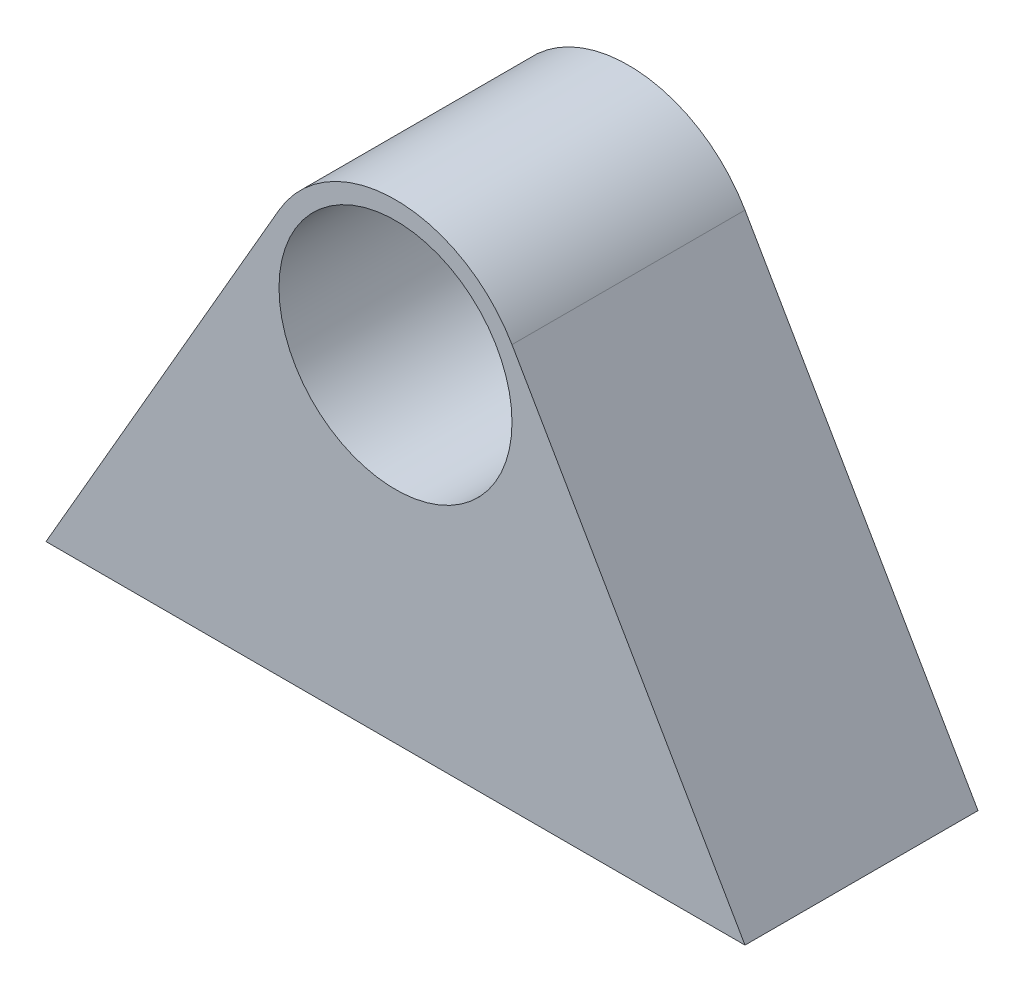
ISO-10303-21;
HEADER;
FILE_DESCRIPTION(('STEP AP214'),'2;1');
FILE_NAME('part.step','',(''),(''),'','','');
FILE_SCHEMA(('AUTOMOTIVE_DESIGN { 1 0 10303 214 1 1 1 1 }'));
ENDSEC;
DATA;
#1=APPLICATION_CONTEXT('core data for automotive mechanical design processes');
#2=APPLICATION_PROTOCOL_DEFINITION('international standard','automotive_design',2000,#1);
#3=PRODUCT_CONTEXT('',#1,'mechanical');
#4=PRODUCT('Part','Part','',(#3));
#5=PRODUCT_RELATED_PRODUCT_CATEGORY('part','',(#4));
#6=PRODUCT_DEFINITION_FORMATION('','',#4);
#7=PRODUCT_DEFINITION_CONTEXT('part definition',#1,'design');
#8=PRODUCT_DEFINITION('design','',#6,#7);
#9=PRODUCT_DEFINITION_SHAPE('','',#8);
#10=(LENGTH_UNIT() NAMED_UNIT(*) SI_UNIT(.MILLI.,.METRE.));
#11=(NAMED_UNIT(*) PLANE_ANGLE_UNIT() SI_UNIT($,.RADIAN.));
#12=(NAMED_UNIT(*) SI_UNIT($,.STERADIAN.) SOLID_ANGLE_UNIT());
#13=UNCERTAINTY_MEASURE_WITH_UNIT(LENGTH_MEASURE(1.E-05),#10,'distance_accuracy_value','');
#14=(GEOMETRIC_REPRESENTATION_CONTEXT(3) GLOBAL_UNCERTAINTY_ASSIGNED_CONTEXT((#13)) GLOBAL_UNIT_ASSIGNED_CONTEXT((#10,
#11,#12)) REPRESENTATION_CONTEXT('',''));
#15=CARTESIAN_POINT('',(0.,0.,0.));
#16=DIRECTION('',(0.,0.,1.));
#17=DIRECTION('',(1.,0.,0.));
#18=AXIS2_PLACEMENT_3D('',#15,#16,#17);
#19=CARTESIAN_POINT('',(30.,0.,10.));
#20=DIRECTION('',(0.,1.,0.));
#21=DIRECTION('',(-1.,0.,0.));
#22=AXIS2_PLACEMENT_3D('',#19,#20,#21);
#23=PLANE('',#22);
#24=DIRECTION('',(1.,0.,0.));
#25=VECTOR('',#24,1.);
#26=CARTESIAN_POINT('',(30.,0.,0.));
#27=LINE('',#26,#25);
#28=CARTESIAN_POINT('',(0.,0.,0.));
#29=VERTEX_POINT('',#28);
#30=CARTESIAN_POINT('',(30.,0.,0.));
#31=VERTEX_POINT('',#30);
#32=EDGE_CURVE('E96',#29,#31,#27,.T.);
#33=ORIENTED_EDGE('',*,*,#32,.T.);
#34=DIRECTION('',(0.,0.,-1.));
#35=VECTOR('',#34,1.);
#36=CARTESIAN_POINT('',(30.,0.,10.));
#37=LINE('',#36,#35);
#38=CARTESIAN_POINT('',(30.,0.,10.));
#39=VERTEX_POINT('',#38);
#40=EDGE_CURVE('E11',#39,#31,#37,.T.);
#41=ORIENTED_EDGE('',*,*,#40,.F.);
#42=DIRECTION('',(1.,0.,0.));
#43=VECTOR('',#42,1.);
#44=CARTESIAN_POINT('',(30.,0.,10.));
#45=LINE('',#44,#43);
#46=CARTESIAN_POINT('',(0.,0.,10.));
#47=VERTEX_POINT('',#46);
#48=EDGE_CURVE('E84',#47,#39,#45,.T.);
#49=ORIENTED_EDGE('',*,*,#48,.F.);
#50=DIRECTION('',(0.,0.,-1.));
#51=VECTOR('',#50,1.);
#52=CARTESIAN_POINT('',(0.,0.,10.));
#53=LINE('',#52,#51);
#54=EDGE_CURVE('E92',#47,#29,#53,.T.);
#55=ORIENTED_EDGE('',*,*,#54,.T.);
#56=EDGE_LOOP('',(#33,#41,#49,#55));
#57=FACE_BOUND('',#56,.T.);
#58=ADVANCED_FACE('F33',(#57),#23,.F.);
#59=CARTESIAN_POINT('',(19.9999999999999,17.3205080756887,10.));
#60=DIRECTION('',(-0.866025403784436,-0.500000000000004,0.));
#61=DIRECTION('',(0.500000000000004,-0.866025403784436,0.));
#62=AXIS2_PLACEMENT_3D('',#59,#60,#61);
#63=PLANE('',#62);
#64=DIRECTION('',(-0.500000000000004,0.866025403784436,0.));
#65=VECTOR('',#64,1.);
#66=CARTESIAN_POINT('',(19.9999999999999,17.3205080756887,0.));
#67=LINE('',#66,#65);
#68=CARTESIAN_POINT('',(19.9999999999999,17.3205080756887,0.));
#69=VERTEX_POINT('',#68);
#70=EDGE_CURVE('E88',#31,#69,#67,.T.);
#71=ORIENTED_EDGE('',*,*,#70,.T.);
#72=DIRECTION('',(0.,0.,-1.));
#73=VECTOR('',#72,1.);
#74=CARTESIAN_POINT('',(19.9999999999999,17.3205080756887,10.));
#75=LINE('',#74,#73);
#76=CARTESIAN_POINT('',(19.9999999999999,17.3205080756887,10.));
#77=VERTEX_POINT('',#76);
#78=EDGE_CURVE('E41',#77,#69,#75,.T.);
#79=ORIENTED_EDGE('',*,*,#78,.F.);
#80=DIRECTION('',(-0.500000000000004,0.866025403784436,0.));
#81=VECTOR('',#80,1.);
#82=CARTESIAN_POINT('',(19.9999999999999,17.3205080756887,10.));
#83=LINE('',#82,#81);
#84=EDGE_CURVE('E79',#39,#77,#83,.T.);
#85=ORIENTED_EDGE('',*,*,#84,.F.);
#86=ORIENTED_EDGE('',*,*,#40,.T.);
#87=EDGE_LOOP('',(#71,#79,#85,#86));
#88=FACE_BOUND('',#87,.T.);
#89=ADVANCED_FACE('F87',(#88),#63,.F.);
#90=CARTESIAN_POINT('',(15.,14.4337567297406,10.));
#91=DIRECTION('',(0.,0.,-1.));
#92=DIRECTION('',(-1.,0.,0.));
#93=AXIS2_PLACEMENT_3D('',#90,#91,#92);
#94=CYLINDRICAL_SURFACE('',#93,5.77350269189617);
#95=CARTESIAN_POINT('',(15.,14.4337567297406,0.));
#96=DIRECTION('',(0.,0.,1.));
#97=DIRECTION('',(-1.,0.,0.));
#98=AXIS2_PLACEMENT_3D('',#95,#96,#97);
#99=CIRCLE('',#98,5.77350269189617);
#100=CARTESIAN_POINT('',(10.0000000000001,17.3205080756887,0.));
#101=VERTEX_POINT('',#100);
#102=EDGE_CURVE('E66',#69,#101,#99,.T.);
#103=ORIENTED_EDGE('',*,*,#102,.T.);
#104=DIRECTION('',(0.,0.,-1.));
#105=VECTOR('',#104,1.);
#106=CARTESIAN_POINT('',(10.0000000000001,17.3205080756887,10.));
#107=LINE('',#106,#105);
#108=CARTESIAN_POINT('',(10.0000000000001,17.3205080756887,10.));
#109=VERTEX_POINT('',#108);
#110=EDGE_CURVE('E89',#109,#101,#107,.T.);
#111=ORIENTED_EDGE('',*,*,#110,.F.);
#112=CARTESIAN_POINT('',(15.,14.4337567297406,10.));
#113=DIRECTION('',(0.,0.,1.));
#114=DIRECTION('',(-1.,0.,0.));
#115=AXIS2_PLACEMENT_3D('',#112,#113,#114);
#116=CIRCLE('',#115,5.77350269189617);
#117=EDGE_CURVE('E82',#77,#109,#116,.T.);
#118=ORIENTED_EDGE('',*,*,#117,.F.);
#119=ORIENTED_EDGE('',*,*,#78,.T.);
#120=EDGE_LOOP('',(#103,#111,#118,#119));
#121=FACE_BOUND('',#120,.T.);
#122=ADVANCED_FACE('F90',(#121),#94,.T.);
#123=CARTESIAN_POINT('',(0.,0.,10.));
#124=DIRECTION('',(0.866025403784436,-0.500000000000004,0.));
#125=DIRECTION('',(0.500000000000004,0.866025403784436,0.));
#126=AXIS2_PLACEMENT_3D('',#123,#124,#125);
#127=PLANE('',#126);
#128=DIRECTION('',(-0.500000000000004,-0.866025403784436,0.));
#129=VECTOR('',#128,1.);
#130=CARTESIAN_POINT('',(0.,0.,0.));
#131=LINE('',#130,#129);
#132=EDGE_CURVE('E72',#101,#29,#131,.T.);
#133=ORIENTED_EDGE('',*,*,#132,.T.);
#134=ORIENTED_EDGE('',*,*,#54,.F.);
#135=DIRECTION('',(-0.500000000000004,-0.866025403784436,0.));
#136=VECTOR('',#135,1.);
#137=CARTESIAN_POINT('',(0.,0.,10.));
#138=LINE('',#137,#136);
#139=EDGE_CURVE('E49',#109,#47,#138,.T.);
#140=ORIENTED_EDGE('',*,*,#139,.F.);
#141=ORIENTED_EDGE('',*,*,#110,.T.);
#142=EDGE_LOOP('',(#133,#134,#140,#141));
#143=FACE_BOUND('',#142,.T.);
#144=ADVANCED_FACE('F104',(#143),#127,.F.);
#145=CARTESIAN_POINT('',(15.,14.4337567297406,10.));
#146=DIRECTION('',(0.,0.,-1.));
#147=DIRECTION('',(-1.,0.,0.));
#148=AXIS2_PLACEMENT_3D('',#145,#146,#147);
#149=PLANE('',#148);
#150=CARTESIAN_POINT('',(15.,14.4337567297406,10.));
#151=DIRECTION('',(0.,0.,1.));
#152=DIRECTION('',(1.,0.,0.));
#153=AXIS2_PLACEMENT_3D('',#150,#151,#152);
#154=CIRCLE('',#153,4.99999999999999);
#155=CARTESIAN_POINT('',(20.,14.4337567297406,10.));
#156=VERTEX_POINT('',#155);
#157=EDGE_CURVE('E110',#156,#156,#154,.T.);
#158=ORIENTED_EDGE('',*,*,#157,.F.);
#159=EDGE_LOOP('',(#158));
#160=FACE_BOUND('',#159,.T.);
#161=ORIENTED_EDGE('',*,*,#48,.T.);
#162=ORIENTED_EDGE('',*,*,#84,.T.);
#163=ORIENTED_EDGE('',*,*,#117,.T.);
#164=ORIENTED_EDGE('',*,*,#139,.T.);
#165=EDGE_LOOP('',(#161,#162,#163,#164));
#166=FACE_BOUND('',#165,.T.);
#167=ADVANCED_FACE('F80',(#160,#166),#149,.F.);
#168=CARTESIAN_POINT('',(15.,14.4337567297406,0.));
#169=DIRECTION('',(0.,0.,-1.));
#170=DIRECTION('',(-1.,0.,0.));
#171=AXIS2_PLACEMENT_3D('',#168,#169,#170);
#172=PLANE('',#171);
#173=CARTESIAN_POINT('',(15.,14.4337567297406,0.));
#174=DIRECTION('',(0.,0.,1.));
#175=DIRECTION('',(1.,0.,0.));
#176=AXIS2_PLACEMENT_3D('',#173,#174,#175);
#177=CIRCLE('',#176,4.99999999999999);
#178=CARTESIAN_POINT('',(20.,14.4337567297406,0.));
#179=VERTEX_POINT('',#178);
#180=EDGE_CURVE('E99',#179,#179,#177,.T.);
#181=ORIENTED_EDGE('',*,*,#180,.T.);
#182=EDGE_LOOP('',(#181));
#183=FACE_BOUND('',#182,.T.);
#184=ORIENTED_EDGE('',*,*,#32,.F.);
#185=ORIENTED_EDGE('',*,*,#132,.F.);
#186=ORIENTED_EDGE('',*,*,#102,.F.);
#187=ORIENTED_EDGE('',*,*,#70,.F.);
#188=EDGE_LOOP('',(#184,#185,#186,#187));
#189=FACE_BOUND('',#188,.T.);
#190=ADVANCED_FACE('F107',(#183,#189),#172,.T.);
#191=CARTESIAN_POINT('',(15.,14.4337567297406,0.));
#192=DIRECTION('',(0.,0.,1.));
#193=DIRECTION('',(1.,0.,0.));
#194=AXIS2_PLACEMENT_3D('',#191,#192,#193);
#195=CYLINDRICAL_SURFACE('',#194,4.99999999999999);
#196=ORIENTED_EDGE('',*,*,#180,.F.);
#197=EDGE_LOOP('',(#196));
#198=FACE_BOUND('',#197,.T.);
#199=ORIENTED_EDGE('',*,*,#157,.T.);
#200=EDGE_LOOP('',(#199));
#201=FACE_BOUND('',#200,.T.);
#202=ADVANCED_FACE('F117',(#198,#201),#195,.F.);
#203=CLOSED_SHELL('',(#58,#89,#122,#144,#167,#190,#202));
#204=MANIFOLD_SOLID_BREP('B2',#203);
#205=ADVANCED_BREP_SHAPE_REPRESENTATION('',(#18,#204),#14);
#206=SHAPE_DEFINITION_REPRESENTATION(#9,#205);
ENDSEC;
END-ISO-10303-21;
